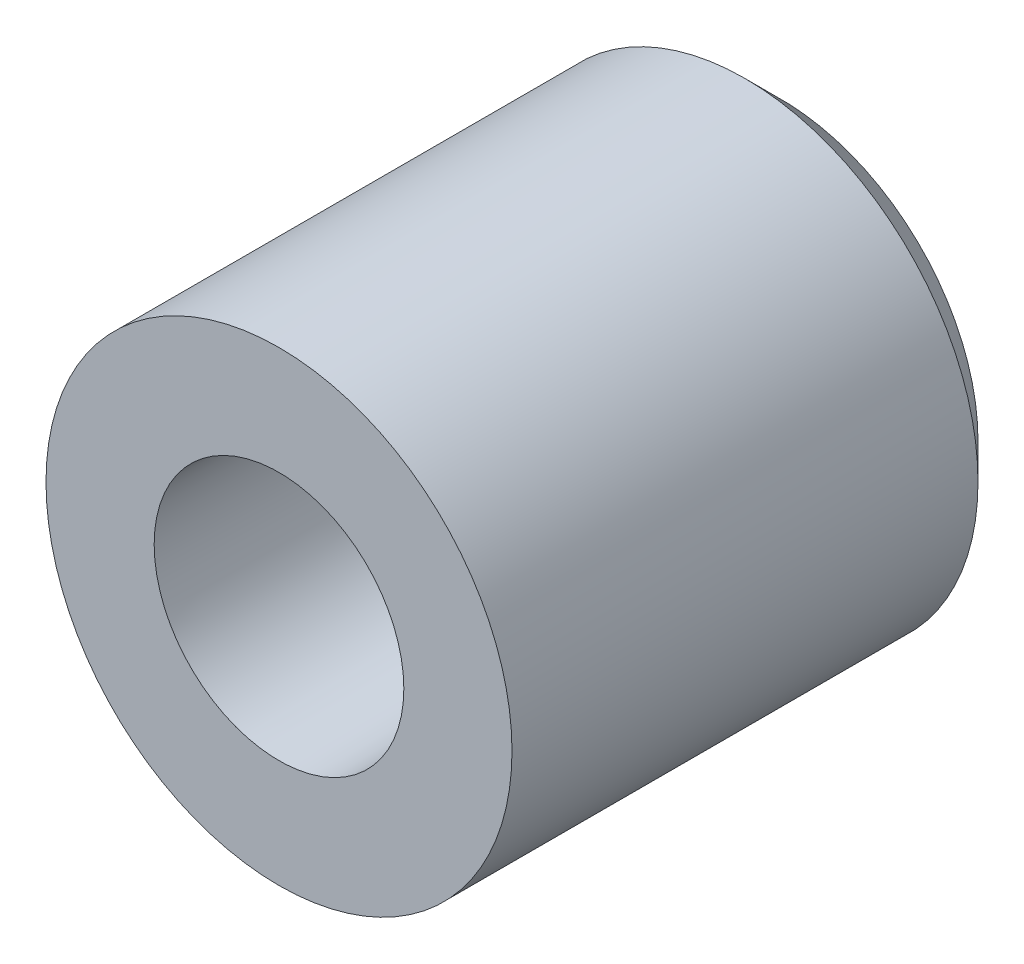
ISO-10303-21;
HEADER;
FILE_DESCRIPTION(('STEP AP214'),'2;1');
FILE_NAME('part.step','',(''),(''),'','','');
FILE_SCHEMA(('AUTOMOTIVE_DESIGN { 1 0 10303 214 1 1 1 1 }'));
ENDSEC;
DATA;
#1=APPLICATION_CONTEXT('core data for automotive mechanical design processes');
#2=APPLICATION_PROTOCOL_DEFINITION('international standard','automotive_design',2000,#1);
#3=PRODUCT_CONTEXT('',#1,'mechanical');
#4=PRODUCT('Part','Part','',(#3));
#5=PRODUCT_RELATED_PRODUCT_CATEGORY('part','',(#4));
#6=PRODUCT_DEFINITION_FORMATION('','',#4);
#7=PRODUCT_DEFINITION_CONTEXT('part definition',#1,'design');
#8=PRODUCT_DEFINITION('design','',#6,#7);
#9=PRODUCT_DEFINITION_SHAPE('','',#8);
#10=(LENGTH_UNIT() NAMED_UNIT(*) SI_UNIT(.MILLI.,.METRE.));
#11=(NAMED_UNIT(*) PLANE_ANGLE_UNIT() SI_UNIT($,.RADIAN.));
#12=(NAMED_UNIT(*) SI_UNIT($,.STERADIAN.) SOLID_ANGLE_UNIT());
#13=UNCERTAINTY_MEASURE_WITH_UNIT(LENGTH_MEASURE(1.E-05),#10,'distance_accuracy_value','');
#14=(GEOMETRIC_REPRESENTATION_CONTEXT(3) GLOBAL_UNCERTAINTY_ASSIGNED_CONTEXT((#13)) GLOBAL_UNIT_ASSIGNED_CONTEXT((#10,
#11,#12)) REPRESENTATION_CONTEXT('',''));
#15=CARTESIAN_POINT('',(0.,0.,0.));
#16=DIRECTION('',(0.,0.,1.));
#17=DIRECTION('',(1.,0.,0.));
#18=AXIS2_PLACEMENT_3D('',#15,#16,#17);
#19=CARTESIAN_POINT('',(0.,0.,-6.59363327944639));
#20=DIRECTION('',(0.,0.,1.));
#21=DIRECTION('',(1.,0.,0.));
#22=AXIS2_PLACEMENT_3D('',#19,#20,#21);
#23=CONICAL_SURFACE('',#22,4.8016363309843,0.785398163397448);
#24=CARTESIAN_POINT('',(0.,0.,-9.));
#25=DIRECTION('',(0.,0.,1.));
#26=DIRECTION('',(-1.,0.,0.));
#27=AXIS2_PLACEMENT_3D('',#24,#25,#26);
#28=CIRCLE('',#27,2.39526961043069);
#29=CARTESIAN_POINT('',(2.39526961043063,0.,-9.));
#30=VERTEX_POINT('',#29);
#31=CARTESIAN_POINT('',(-2.39526961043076,0.,-9.));
#32=VERTEX_POINT('',#31);
#33=EDGE_CURVE('E143',#30,#32,#28,.T.);
#34=ORIENTED_EDGE('',*,*,#33,.F.);
#35=CARTESIAN_POINT('',(2.39527123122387,0.,-8.99999837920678));
#36=CARTESIAN_POINT('',(3.39527046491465,0.,-7.99999914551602));
#37=B_SPLINE_CURVE_WITH_KNOTS('',1,(#35,#36),.UNSPECIFIED.,.F.,.F.,(2,2),(0.498844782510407,
0.707106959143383),.UNSPECIFIED.);
#38=CARTESIAN_POINT('',(3.39526961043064,0.,-8.));
#39=VERTEX_POINT('',#38);
#40=EDGE_CURVE('E44',#30,#39,#37,.T.);
#41=ORIENTED_EDGE('',*,*,#40,.T.);
#42=CARTESIAN_POINT('',(0.,0.,-8.));
#43=DIRECTION('',(0.,0.,-1.));
#44=DIRECTION('',(-1.,0.,0.));
#45=AXIS2_PLACEMENT_3D('',#42,#43,#44);
#46=CIRCLE('',#45,3.39526961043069);
#47=CARTESIAN_POINT('',(-3.39526961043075,0.,-8.));
#48=VERTEX_POINT('',#47);
#49=EDGE_CURVE('E11',#48,#39,#46,.T.);
#50=ORIENTED_EDGE('',*,*,#49,.F.);
#51=CARTESIAN_POINT('',(0.,0.,-8.));
#52=DIRECTION('',(0.,0.,-1.));
#53=DIRECTION('',(-1.,0.,0.));
#54=AXIS2_PLACEMENT_3D('',#51,#52,#53);
#55=CIRCLE('',#54,3.39526961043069);
#56=EDGE_CURVE('E51',#39,#48,#55,.T.);
#57=ORIENTED_EDGE('',*,*,#56,.F.);
#58=ORIENTED_EDGE('',*,*,#40,.F.);
#59=CARTESIAN_POINT('',(0.,0.,-9.));
#60=DIRECTION('',(0.,0.,1.));
#61=DIRECTION('',(-1.,0.,0.));
#62=AXIS2_PLACEMENT_3D('',#59,#60,#61);
#63=CIRCLE('',#62,2.39526961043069);
#64=EDGE_CURVE('E59',#32,#30,#63,.T.);
#65=ORIENTED_EDGE('',*,*,#64,.F.);
#66=EDGE_LOOP('',(#34,#41,#50,#57,#58,#65));
#67=FACE_BOUND('',#66,.T.);
#68=ADVANCED_FACE('F36',(#67),#23,.F.);
#69=CARTESIAN_POINT('',(0.,0.,-7.5));
#70=DIRECTION('',(0.,0.,-1.));
#71=DIRECTION('',(-1.,0.,0.));
#72=AXIS2_PLACEMENT_3D('',#69,#70,#71);
#73=CYLINDRICAL_SURFACE('',#72,3.39526961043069);
#74=CARTESIAN_POINT('',(0.,0.,-6.));
#75=DIRECTION('',(0.,0.,-1.));
#76=DIRECTION('',(-1.,0.,0.));
#77=AXIS2_PLACEMENT_3D('',#74,#75,#76);
#78=CIRCLE('',#77,3.39526961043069);
#79=CARTESIAN_POINT('',(-3.39526961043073,0.,-6.));
#80=VERTEX_POINT('',#79);
#81=EDGE_CURVE('E152',#80,#80,#78,.T.);
#82=ORIENTED_EDGE('',*,*,#81,.F.);
#83=CARTESIAN_POINT('',(-3.39526961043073,0.,-5.99999694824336));
#84=CARTESIAN_POINT('',(-3.39526961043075,0.,-8.000002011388));
#85=B_SPLINE_CURVE_WITH_KNOTS('',1,(#83,#84),.UNSPECIFIED.,.F.,.F.,(2,2),(0.0833320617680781,
0.91666750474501),.UNSPECIFIED.);
#86=EDGE_CURVE('E147',#80,#48,#85,.T.);
#87=ORIENTED_EDGE('',*,*,#86,.T.);
#88=ORIENTED_EDGE('',*,*,#49,.T.);
#89=ORIENTED_EDGE('',*,*,#56,.T.);
#90=ORIENTED_EDGE('',*,*,#86,.F.);
#91=EDGE_LOOP('',(#82,#87,#88,#89,#90));
#92=FACE_BOUND('',#91,.T.);
#93=ADVANCED_FACE('F191',(#92),#73,.F.);
#94=CARTESIAN_POINT('',(5.50912010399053,-4.97847439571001,-9.));
#95=DIRECTION('',(0.,0.,-1.));
#96=DIRECTION('',(-1.,0.,0.));
#97=AXIS2_PLACEMENT_3D('',#94,#95,#96);
#98=PLANE('',#97);
#99=CARTESIAN_POINT('',(-1.04744440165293E-13,0.,-8.99999999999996));
#100=DIRECTION('',(0.,0.,-1.));
#101=DIRECTION('',(-1.,0.,0.));
#102=AXIS2_PLACEMENT_3D('',#99,#100,#101);
#103=CIRCLE('',#102,1.64999999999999);
#104=CARTESIAN_POINT('',(-1.6500000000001,0.,-8.99999999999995));
#105=VERTEX_POINT('',#104);
#106=EDGE_CURVE('E103',#105,#105,#103,.T.);
#107=ORIENTED_EDGE('',*,*,#106,.T.);
#108=EDGE_LOOP('',(#107));
#109=FACE_BOUND('',#108,.T.);
#110=ORIENTED_EDGE('',*,*,#64,.T.);
#111=ORIENTED_EDGE('',*,*,#33,.T.);
#112=EDGE_LOOP('',(#110,#111));
#113=FACE_BOUND('',#112,.T.);
#114=ADVANCED_FACE('F193',(#109,#113),#98,.F.);
#115=CARTESIAN_POINT('',(0.,0.,-1.));
#116=DIRECTION('',(0.,0.,1.));
#117=DIRECTION('',(-1.,0.,0.));
#118=AXIS2_PLACEMENT_3D('',#115,#116,#117);
#119=CONICAL_SURFACE('',#118,3.48254493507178,0.0174532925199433);
#120=ORIENTED_EDGE('',*,*,#81,.T.);
#121=CARTESIAN_POINT('',(-3.39526961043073,0.,-6.));
#122=CARTESIAN_POINT('',(-3.48254493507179,0.,-0.999999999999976));
#123=B_SPLINE_CURVE_WITH_KNOTS('',1,(#121,#122),.UNSPECIFIED.,.F.,.F.,(2,2),(0.,1.),.UNSPECIFIED.);
#124=CARTESIAN_POINT('',(-3.48254493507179,0.,-0.999999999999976));
#125=VERTEX_POINT('',#124);
#126=EDGE_CURVE('E108',#80,#125,#123,.T.);
#127=ORIENTED_EDGE('',*,*,#126,.T.);
#128=CARTESIAN_POINT('',(0.,0.,-1.));
#129=DIRECTION('',(0.,0.,-1.));
#130=DIRECTION('',(1.,0.,0.));
#131=AXIS2_PLACEMENT_3D('',#128,#129,#130);
#132=CIRCLE('',#131,3.48254493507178);
#133=CARTESIAN_POINT('',(3.48254493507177,0.,-1.00000000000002));
#134=VERTEX_POINT('',#133);
#135=EDGE_CURVE('E133',#134,#125,#132,.T.);
#136=ORIENTED_EDGE('',*,*,#135,.F.);
#137=CARTESIAN_POINT('',(0.,0.,-1.));
#138=DIRECTION('',(0.,0.,-1.));
#139=DIRECTION('',(1.,0.,0.));
#140=AXIS2_PLACEMENT_3D('',#137,#138,#139);
#141=CIRCLE('',#140,3.48254493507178);
#142=EDGE_CURVE('E126',#125,#134,#141,.T.);
#143=ORIENTED_EDGE('',*,*,#142,.F.);
#144=ORIENTED_EDGE('',*,*,#126,.F.);
#145=EDGE_LOOP('',(#120,#127,#136,#143,#144));
#146=FACE_BOUND('',#145,.T.);
#147=ADVANCED_FACE('F189',(#146),#119,.F.);
#148=CARTESIAN_POINT('',(0.,0.,-11.3076118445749));
#149=DIRECTION('',(0.,0.,1.));
#150=DIRECTION('',(1.,0.,0.));
#151=AXIS2_PLACEMENT_3D('',#148,#149,#150);
#152=CONICAL_SURFACE('',#151,9.19238815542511,0.785398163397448);
#153=CARTESIAN_POINT('',(-1.04744440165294E-13,0.,-15.));
#154=DIRECTION('',(0.,0.,1.));
#155=DIRECTION('',(-1.,0.,0.));
#156=AXIS2_PLACEMENT_3D('',#153,#154,#155);
#157=CIRCLE('',#156,5.5);
#158=CARTESIAN_POINT('',(-5.50000000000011,0.,-15.));
#159=VERTEX_POINT('',#158);
#160=CARTESIAN_POINT('',(5.4999999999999,0.,-15.));
#161=VERTEX_POINT('',#160);
#162=EDGE_CURVE('E90',#159,#161,#157,.T.);
#163=ORIENTED_EDGE('',*,*,#162,.T.);
#164=CARTESIAN_POINT('',(5.50000026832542,0.,-14.9999997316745));
#165=CARTESIAN_POINT('',(6.50000039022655,0.,-13.9999996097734));
#166=B_SPLINE_CURVE_WITH_KNOTS('',1,(#164,#165),.UNSPECIFIED.,.F.,.F.,(2,2),(0.598321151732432,
0.707106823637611),.UNSPECIFIED.);
#167=CARTESIAN_POINT('',(6.4999999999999,0.,-14.));
#168=VERTEX_POINT('',#167);
#169=EDGE_CURVE('E95',#161,#168,#166,.T.);
#170=ORIENTED_EDGE('',*,*,#169,.T.);
#171=CARTESIAN_POINT('',(0.,0.,-14.));
#172=DIRECTION('',(0.,0.,-1.));
#173=DIRECTION('',(-1.,0.,0.));
#174=AXIS2_PLACEMENT_3D('',#171,#172,#173);
#175=CIRCLE('',#174,6.5);
#176=CARTESIAN_POINT('',(-6.5000000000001,0.,-14.));
#177=VERTEX_POINT('',#176);
#178=EDGE_CURVE('E102',#168,#177,#175,.T.);
#179=ORIENTED_EDGE('',*,*,#178,.T.);
#180=CARTESIAN_POINT('',(0.,0.,-14.));
#181=DIRECTION('',(0.,0.,-1.));
#182=DIRECTION('',(-1.,0.,0.));
#183=AXIS2_PLACEMENT_3D('',#180,#181,#182);
#184=CIRCLE('',#183,6.5);
#185=EDGE_CURVE('E105',#177,#168,#184,.T.);
#186=ORIENTED_EDGE('',*,*,#185,.T.);
#187=ORIENTED_EDGE('',*,*,#169,.F.);
#188=CARTESIAN_POINT('',(-1.04744440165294E-13,0.,-15.));
#189=DIRECTION('',(0.,0.,1.));
#190=DIRECTION('',(-1.,0.,0.));
#191=AXIS2_PLACEMENT_3D('',#188,#189,#190);
#192=CIRCLE('',#191,5.5);
#193=EDGE_CURVE('E97',#161,#159,#192,.T.);
#194=ORIENTED_EDGE('',*,*,#193,.T.);
#195=EDGE_LOOP('',(#163,#170,#179,#186,#187,#194));
#196=FACE_BOUND('',#195,.T.);
#197=ADVANCED_FACE('F92',(#196),#152,.T.);
#198=CARTESIAN_POINT('',(0.,0.,-8.));
#199=DIRECTION('',(0.,0.,-1.));
#200=DIRECTION('',(-1.,0.,0.));
#201=AXIS2_PLACEMENT_3D('',#198,#199,#200);
#202=CYLINDRICAL_SURFACE('',#201,6.5);
#203=CARTESIAN_POINT('',(0.,0.,-1.));
#204=DIRECTION('',(0.,0.,1.));
#205=DIRECTION('',(-1.,0.,0.));
#206=AXIS2_PLACEMENT_3D('',#203,#204,#205);
#207=CIRCLE('',#206,6.5);
#208=CARTESIAN_POINT('',(-6.5,0.,-0.999999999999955));
#209=VERTEX_POINT('',#208);
#210=EDGE_CURVE('E99',#209,#209,#207,.T.);
#211=ORIENTED_EDGE('',*,*,#210,.F.);
#212=CARTESIAN_POINT('',(-6.5,0.,-1.00000099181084));
#213=CARTESIAN_POINT('',(-6.5000000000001,0.,-14.0000013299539));
#214=B_SPLINE_CURVE_WITH_KNOTS('',1,(#212,#213),.UNSPECIFIED.,.F.,.F.,(2,2),(0.0833333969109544,
0.916666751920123),.UNSPECIFIED.);
#215=EDGE_CURVE('E173',#209,#177,#214,.T.);
#216=ORIENTED_EDGE('',*,*,#215,.T.);
#217=ORIENTED_EDGE('',*,*,#178,.F.);
#218=ORIENTED_EDGE('',*,*,#185,.F.);
#219=ORIENTED_EDGE('',*,*,#215,.F.);
#220=EDGE_LOOP('',(#211,#216,#217,#218,#219));
#221=FACE_BOUND('',#220,.T.);
#222=ADVANCED_FACE('F225',(#221),#202,.T.);
#223=CARTESIAN_POINT('',(12.65,-11.4315353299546,-15.));
#224=DIRECTION('',(0.,0.,-1.));
#225=DIRECTION('',(-1.,0.,0.));
#226=AXIS2_PLACEMENT_3D('',#223,#224,#225);
#227=PLANE('',#226);
#228=CARTESIAN_POINT('',(-1.04744440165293E-13,0.,-14.9999999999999));
#229=DIRECTION('',(0.,0.,-1.));
#230=DIRECTION('',(-1.,0.,0.));
#231=AXIS2_PLACEMENT_3D('',#228,#229,#230);
#232=CIRCLE('',#231,1.64999999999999);
#233=CARTESIAN_POINT('',(-1.65000000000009,0.,-14.9999999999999));
#234=VERTEX_POINT('',#233);
#235=EDGE_CURVE('E275',#234,#234,#232,.T.);
#236=ORIENTED_EDGE('',*,*,#235,.F.);
#237=EDGE_LOOP('',(#236));
#238=FACE_BOUND('',#237,.T.);
#239=ORIENTED_EDGE('',*,*,#193,.F.);
#240=ORIENTED_EDGE('',*,*,#162,.F.);
#241=EDGE_LOOP('',(#239,#240));
#242=FACE_BOUND('',#241,.T.);
#243=ADVANCED_FACE('F101',(#238,#242),#227,.T.);
#244=CARTESIAN_POINT('',(-8.45,-13.5099962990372,-0.999999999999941));
#245=DIRECTION('',(0.,0.,1.));
#246=DIRECTION('',(1.,0.,0.));
#247=AXIS2_PLACEMENT_3D('',#244,#245,#246);
#248=PLANE('',#247);
#249=ORIENTED_EDGE('',*,*,#210,.T.);
#250=EDGE_LOOP('',(#249));
#251=FACE_BOUND('',#250,.T.);
#252=ORIENTED_EDGE('',*,*,#135,.T.);
#253=ORIENTED_EDGE('',*,*,#142,.T.);
#254=EDGE_LOOP('',(#252,#253));
#255=FACE_BOUND('',#254,.T.);
#256=ADVANCED_FACE('F240',(#251,#255),#248,.T.);
#257=CARTESIAN_POINT('',(-1.04744440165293E-13,0.,-14.9999999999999));
#258=DIRECTION('',(0.,0.,-1.));
#259=DIRECTION('',(-1.,0.,0.));
#260=AXIS2_PLACEMENT_3D('',#257,#258,#259);
#261=CYLINDRICAL_SURFACE('',#260,1.64999999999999);
#262=ORIENTED_EDGE('',*,*,#235,.T.);
#263=EDGE_LOOP('',(#262));
#264=FACE_BOUND('',#263,.T.);
#265=ORIENTED_EDGE('',*,*,#106,.F.);
#266=EDGE_LOOP('',(#265));
#267=FACE_BOUND('',#266,.T.);
#268=ADVANCED_FACE('F248',(#264,#267),#261,.F.);
#269=CLOSED_SHELL('',(#68,#93,#114,#147,#197,#222,#243,#256,#268));
#270=MANIFOLD_SOLID_BREP('B2',#269);
#271=ADVANCED_BREP_SHAPE_REPRESENTATION('',(#18,#270),#14);
#272=SHAPE_DEFINITION_REPRESENTATION(#9,#271);
ENDSEC;
END-ISO-10303-21;
